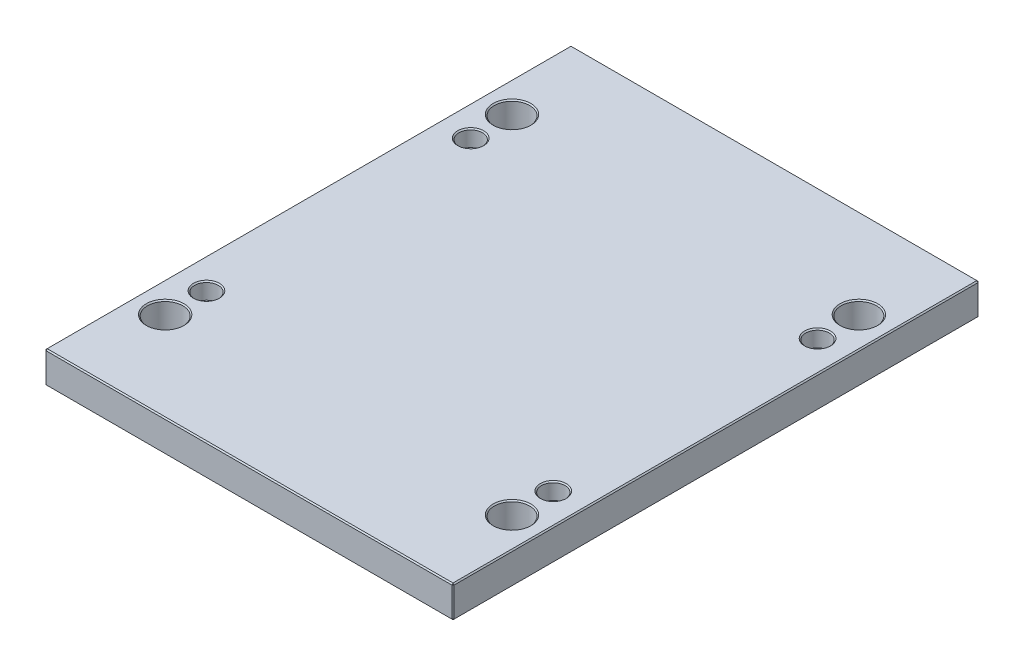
ISO-10303-21;
HEADER;
FILE_DESCRIPTION(('STEP AP214'),'2;1');
FILE_NAME('part.step','',(''),(''),'','','');
FILE_SCHEMA(('AUTOMOTIVE_DESIGN { 1 0 10303 214 1 1 1 1 }'));
ENDSEC;
DATA;
#1=APPLICATION_CONTEXT('core data for automotive mechanical design processes');
#2=APPLICATION_PROTOCOL_DEFINITION('international standard','automotive_design',2000,#1);
#3=PRODUCT_CONTEXT('',#1,'mechanical');
#4=PRODUCT('Part','Part','',(#3));
#5=PRODUCT_RELATED_PRODUCT_CATEGORY('part','',(#4));
#6=PRODUCT_DEFINITION_FORMATION('','',#4);
#7=PRODUCT_DEFINITION_CONTEXT('part definition',#1,'design');
#8=PRODUCT_DEFINITION('design','',#6,#7);
#9=PRODUCT_DEFINITION_SHAPE('','',#8);
#10=(LENGTH_UNIT() NAMED_UNIT(*) SI_UNIT(.MILLI.,.METRE.));
#11=(NAMED_UNIT(*) PLANE_ANGLE_UNIT() SI_UNIT($,.RADIAN.));
#12=(NAMED_UNIT(*) SI_UNIT($,.STERADIAN.) SOLID_ANGLE_UNIT());
#13=UNCERTAINTY_MEASURE_WITH_UNIT(LENGTH_MEASURE(1.E-05),#10,'distance_accuracy_value','');
#14=(GEOMETRIC_REPRESENTATION_CONTEXT(3) GLOBAL_UNCERTAINTY_ASSIGNED_CONTEXT((#13)) GLOBAL_UNIT_ASSIGNED_CONTEXT((#10,
#11,#12)) REPRESENTATION_CONTEXT('',''));
#15=CARTESIAN_POINT('',(0.,0.,0.));
#16=DIRECTION('',(0.,0.,1.));
#17=DIRECTION('',(1.,0.,0.));
#18=AXIS2_PLACEMENT_3D('',#15,#16,#17);
#19=CARTESIAN_POINT('',(-173.,27.,223.));
#20=DIRECTION('',(1.,0.,0.));
#21=DIRECTION('',(0.,0.,-1.));
#22=AXIS2_PLACEMENT_3D('',#19,#20,#21);
#23=PLANE('',#22);
#24=DIRECTION('',(0.,-1.,0.));
#25=VECTOR('',#24,1.);
#26=CARTESIAN_POINT('',(-173.,27.,-222.));
#27=LINE('',#26,#25);
#28=CARTESIAN_POINT('',(-173.,26.,-222.));
#29=VERTEX_POINT('',#28);
#30=CARTESIAN_POINT('',(-173.,0.999999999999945,-222.));
#31=VERTEX_POINT('',#30);
#32=EDGE_CURVE('E115',#29,#31,#27,.T.);
#33=ORIENTED_EDGE('',*,*,#32,.T.);
#34=DIRECTION('',(0.,0.,1.));
#35=VECTOR('',#34,1.);
#36=CARTESIAN_POINT('',(-173.,0.999999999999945,223.));
#37=LINE('',#36,#35);
#38=CARTESIAN_POINT('',(-173.,0.999999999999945,222.));
#39=VERTEX_POINT('',#38);
#40=EDGE_CURVE('E111',#31,#39,#37,.T.);
#41=ORIENTED_EDGE('',*,*,#40,.T.);
#42=DIRECTION('',(0.,1.,0.));
#43=VECTOR('',#42,1.);
#44=CARTESIAN_POINT('',(-173.,27.,222.));
#45=LINE('',#44,#43);
#46=CARTESIAN_POINT('',(-173.,26.,222.));
#47=VERTEX_POINT('',#46);
#48=EDGE_CURVE('E104',#39,#47,#45,.T.);
#49=ORIENTED_EDGE('',*,*,#48,.T.);
#50=DIRECTION('',(0.,0.,-1.));
#51=VECTOR('',#50,1.);
#52=CARTESIAN_POINT('',(-173.,26.,-223.));
#53=LINE('',#52,#51);
#54=EDGE_CURVE('E108',#47,#29,#53,.T.);
#55=ORIENTED_EDGE('',*,*,#54,.T.);
#56=EDGE_LOOP('',(#33,#41,#49,#55));
#57=FACE_BOUND('',#56,.T.);
#58=ADVANCED_FACE('F16',(#57),#23,.F.);
#59=CARTESIAN_POINT('',(173.,27.,223.));
#60=DIRECTION('',(0.,0.,-1.));
#61=DIRECTION('',(-1.,0.,0.));
#62=AXIS2_PLACEMENT_3D('',#59,#60,#61);
#63=PLANE('',#62);
#64=DIRECTION('',(-1.,0.,0.));
#65=VECTOR('',#64,1.);
#66=CARTESIAN_POINT('',(-173.,26.,223.));
#67=LINE('',#66,#65);
#68=CARTESIAN_POINT('',(172.,26.,223.));
#69=VERTEX_POINT('',#68);
#70=CARTESIAN_POINT('',(-172.,26.,223.));
#71=VERTEX_POINT('',#70);
#72=EDGE_CURVE('E170',#69,#71,#67,.T.);
#73=ORIENTED_EDGE('',*,*,#72,.T.);
#74=DIRECTION('',(0.,-1.,0.));
#75=VECTOR('',#74,1.);
#76=CARTESIAN_POINT('',(-172.,27.,223.));
#77=LINE('',#76,#75);
#78=CARTESIAN_POINT('',(-172.,0.999999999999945,223.));
#79=VERTEX_POINT('',#78);
#80=EDGE_CURVE('E123',#71,#79,#77,.T.);
#81=ORIENTED_EDGE('',*,*,#80,.T.);
#82=DIRECTION('',(1.,0.,0.));
#83=VECTOR('',#82,1.);
#84=CARTESIAN_POINT('',(173.,0.999999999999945,223.));
#85=LINE('',#84,#83);
#86=CARTESIAN_POINT('',(172.,0.999999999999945,223.));
#87=VERTEX_POINT('',#86);
#88=EDGE_CURVE('E174',#79,#87,#85,.T.);
#89=ORIENTED_EDGE('',*,*,#88,.T.);
#90=DIRECTION('',(0.,1.,0.));
#91=VECTOR('',#90,1.);
#92=CARTESIAN_POINT('',(172.,27.,223.));
#93=LINE('',#92,#91);
#94=EDGE_CURVE('E172',#87,#69,#93,.T.);
#95=ORIENTED_EDGE('',*,*,#94,.T.);
#96=EDGE_LOOP('',(#73,#81,#89,#95));
#97=FACE_BOUND('',#96,.T.);
#98=ADVANCED_FACE('F413',(#97),#63,.F.);
#99=CARTESIAN_POINT('',(173.,27.,223.));
#100=DIRECTION('',(-1.,0.,0.));
#101=DIRECTION('',(0.,0.,1.));
#102=AXIS2_PLACEMENT_3D('',#99,#100,#101);
#103=PLANE('',#102);
#104=DIRECTION('',(0.,0.,-1.));
#105=VECTOR('',#104,1.);
#106=CARTESIAN_POINT('',(173.,0.999999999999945,223.));
#107=LINE('',#106,#105);
#108=CARTESIAN_POINT('',(173.,0.999999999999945,222.));
#109=VERTEX_POINT('',#108);
#110=CARTESIAN_POINT('',(173.,0.999999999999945,-222.));
#111=VERTEX_POINT('',#110);
#112=EDGE_CURVE('E165',#109,#111,#107,.T.);
#113=ORIENTED_EDGE('',*,*,#112,.T.);
#114=DIRECTION('',(0.,1.,0.));
#115=VECTOR('',#114,1.);
#116=CARTESIAN_POINT('',(173.,27.,-222.));
#117=LINE('',#116,#115);
#118=CARTESIAN_POINT('',(173.,26.,-222.));
#119=VERTEX_POINT('',#118);
#120=EDGE_CURVE('E167',#111,#119,#117,.T.);
#121=ORIENTED_EDGE('',*,*,#120,.T.);
#122=DIRECTION('',(0.,0.,1.));
#123=VECTOR('',#122,1.);
#124=CARTESIAN_POINT('',(173.,26.,223.));
#125=LINE('',#124,#123);
#126=CARTESIAN_POINT('',(173.,26.,222.));
#127=VERTEX_POINT('',#126);
#128=EDGE_CURVE('E161',#119,#127,#125,.T.);
#129=ORIENTED_EDGE('',*,*,#128,.T.);
#130=DIRECTION('',(0.,-1.,0.));
#131=VECTOR('',#130,1.);
#132=CARTESIAN_POINT('',(173.,27.,222.));
#133=LINE('',#132,#131);
#134=EDGE_CURVE('E163',#127,#109,#133,.T.);
#135=ORIENTED_EDGE('',*,*,#134,.T.);
#136=EDGE_LOOP('',(#113,#121,#129,#135));
#137=FACE_BOUND('',#136,.T.);
#138=ADVANCED_FACE('F406',(#137),#103,.F.);
#139=CARTESIAN_POINT('',(173.,27.,-223.));
#140=DIRECTION('',(0.,0.,1.));
#141=DIRECTION('',(1.,0.,0.));
#142=AXIS2_PLACEMENT_3D('',#139,#140,#141);
#143=PLANE('',#142);
#144=DIRECTION('',(0.,-1.,0.));
#145=VECTOR('',#144,1.);
#146=CARTESIAN_POINT('',(172.,27.,-223.));
#147=LINE('',#146,#145);
#148=CARTESIAN_POINT('',(172.,26.,-223.));
#149=VERTEX_POINT('',#148);
#150=CARTESIAN_POINT('',(172.,0.999999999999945,-223.));
#151=VERTEX_POINT('',#150);
#152=EDGE_CURVE('E154',#149,#151,#147,.T.);
#153=ORIENTED_EDGE('',*,*,#152,.T.);
#154=DIRECTION('',(-1.,0.,0.));
#155=VECTOR('',#154,1.);
#156=CARTESIAN_POINT('',(173.,0.999999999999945,-223.));
#157=LINE('',#156,#155);
#158=CARTESIAN_POINT('',(-172.,0.999999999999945,-223.));
#159=VERTEX_POINT('',#158);
#160=EDGE_CURVE('E159',#151,#159,#157,.T.);
#161=ORIENTED_EDGE('',*,*,#160,.T.);
#162=DIRECTION('',(0.,1.,0.));
#163=VECTOR('',#162,1.);
#164=CARTESIAN_POINT('',(-172.,27.,-223.));
#165=LINE('',#164,#163);
#166=CARTESIAN_POINT('',(-172.,26.,-223.));
#167=VERTEX_POINT('',#166);
#168=EDGE_CURVE('E156',#159,#167,#165,.T.);
#169=ORIENTED_EDGE('',*,*,#168,.T.);
#170=DIRECTION('',(1.,0.,0.));
#171=VECTOR('',#170,1.);
#172=CARTESIAN_POINT('',(173.,26.,-223.));
#173=LINE('',#172,#171);
#174=EDGE_CURVE('E152',#167,#149,#173,.T.);
#175=ORIENTED_EDGE('',*,*,#174,.T.);
#176=EDGE_LOOP('',(#153,#161,#169,#175));
#177=FACE_BOUND('',#176,.T.);
#178=ADVANCED_FACE('F431',(#177),#143,.F.);
#179=CARTESIAN_POINT('',(0.,27.,0.));
#180=DIRECTION('',(0.,1.,0.));
#181=DIRECTION('',(0.,0.,1.));
#182=AXIS2_PLACEMENT_3D('',#179,#180,#181);
#183=PLANE('',#182);
#184=CARTESIAN_POINT('',(-147.,27.,147.));
#185=DIRECTION('',(0.,1.,0.));
#186=DIRECTION('',(0.,0.,1.));
#187=AXIS2_PLACEMENT_3D('',#184,#185,#186);
#188=CIRCLE('',#187,16.);
#189=CARTESIAN_POINT('',(-147.,27.,163.));
#190=VERTEX_POINT('',#189);
#191=EDGE_CURVE('E317',#190,#190,#188,.F.);
#192=ORIENTED_EDGE('',*,*,#191,.T.);
#193=EDGE_LOOP('',(#192));
#194=FACE_BOUND('',#193,.T.);
#195=CARTESIAN_POINT('',(147.,27.,147.));
#196=DIRECTION('',(0.,1.,0.));
#197=DIRECTION('',(0.,0.,1.));
#198=AXIS2_PLACEMENT_3D('',#195,#196,#197);
#199=CIRCLE('',#198,16.);
#200=CARTESIAN_POINT('',(147.,27.,163.));
#201=VERTEX_POINT('',#200);
#202=EDGE_CURVE('E314',#201,#201,#199,.F.);
#203=ORIENTED_EDGE('',*,*,#202,.T.);
#204=EDGE_LOOP('',(#203));
#205=FACE_BOUND('',#204,.T.);
#206=CARTESIAN_POINT('',(147.,27.,-147.));
#207=DIRECTION('',(0.,1.,0.));
#208=DIRECTION('',(0.,0.,1.));
#209=AXIS2_PLACEMENT_3D('',#206,#207,#208);
#210=CIRCLE('',#209,16.);
#211=CARTESIAN_POINT('',(147.,27.,-131.));
#212=VERTEX_POINT('',#211);
#213=EDGE_CURVE('E311',#212,#212,#210,.F.);
#214=ORIENTED_EDGE('',*,*,#213,.T.);
#215=EDGE_LOOP('',(#214));
#216=FACE_BOUND('',#215,.T.);
#217=CARTESIAN_POINT('',(-147.,27.,-147.));
#218=DIRECTION('',(0.,1.,0.));
#219=DIRECTION('',(0.,0.,1.));
#220=AXIS2_PLACEMENT_3D('',#217,#218,#219);
#221=CIRCLE('',#220,16.);
#222=CARTESIAN_POINT('',(-147.,27.,-131.));
#223=VERTEX_POINT('',#222);
#224=EDGE_CURVE('E308',#223,#223,#221,.F.);
#225=ORIENTED_EDGE('',*,*,#224,.T.);
#226=EDGE_LOOP('',(#225));
#227=FACE_BOUND('',#226,.T.);
#228=CARTESIAN_POINT('',(-147.,27.,112.));
#229=DIRECTION('',(0.,1.,0.));
#230=DIRECTION('',(0.,0.,1.));
#231=AXIS2_PLACEMENT_3D('',#228,#229,#230);
#232=CIRCLE('',#231,11.);
#233=CARTESIAN_POINT('',(-147.,27.,123.));
#234=VERTEX_POINT('',#233);
#235=EDGE_CURVE('E290',#234,#234,#232,.F.);
#236=ORIENTED_EDGE('',*,*,#235,.T.);
#237=EDGE_LOOP('',(#236));
#238=FACE_BOUND('',#237,.T.);
#239=CARTESIAN_POINT('',(147.,27.,112.));
#240=DIRECTION('',(0.,1.,0.));
#241=DIRECTION('',(0.,0.,1.));
#242=AXIS2_PLACEMENT_3D('',#239,#240,#241);
#243=CIRCLE('',#242,11.);
#244=CARTESIAN_POINT('',(147.,27.,123.));
#245=VERTEX_POINT('',#244);
#246=EDGE_CURVE('E287',#245,#245,#243,.F.);
#247=ORIENTED_EDGE('',*,*,#246,.T.);
#248=EDGE_LOOP('',(#247));
#249=FACE_BOUND('',#248,.T.);
#250=CARTESIAN_POINT('',(147.,27.,-112.));
#251=DIRECTION('',(0.,1.,0.));
#252=DIRECTION('',(0.,0.,1.));
#253=AXIS2_PLACEMENT_3D('',#250,#251,#252);
#254=CIRCLE('',#253,11.);
#255=CARTESIAN_POINT('',(147.,27.,-101.));
#256=VERTEX_POINT('',#255);
#257=EDGE_CURVE('E284',#256,#256,#254,.F.);
#258=ORIENTED_EDGE('',*,*,#257,.T.);
#259=EDGE_LOOP('',(#258));
#260=FACE_BOUND('',#259,.T.);
#261=CARTESIAN_POINT('',(-147.,27.,-112.));
#262=DIRECTION('',(0.,1.,0.));
#263=DIRECTION('',(0.,0.,1.));
#264=AXIS2_PLACEMENT_3D('',#261,#262,#263);
#265=CIRCLE('',#264,11.);
#266=CARTESIAN_POINT('',(-147.,27.,-101.));
#267=VERTEX_POINT('',#266);
#268=EDGE_CURVE('E281',#267,#267,#265,.F.);
#269=ORIENTED_EDGE('',*,*,#268,.T.);
#270=EDGE_LOOP('',(#269));
#271=FACE_BOUND('',#270,.T.);
#272=DIRECTION('',(0.,0.,-1.));
#273=VECTOR('',#272,1.);
#274=CARTESIAN_POINT('',(172.,27.,-223.));
#275=LINE('',#274,#273);
#276=CARTESIAN_POINT('',(172.,27.,222.));
#277=VERTEX_POINT('',#276);
#278=CARTESIAN_POINT('',(172.,27.,-222.));
#279=VERTEX_POINT('',#278);
#280=EDGE_CURVE('E31',#277,#279,#275,.T.);
#281=ORIENTED_EDGE('',*,*,#280,.T.);
#282=DIRECTION('',(-1.,0.,0.));
#283=VECTOR('',#282,1.);
#284=CARTESIAN_POINT('',(-173.,27.,-222.));
#285=LINE('',#284,#283);
#286=CARTESIAN_POINT('',(-172.,27.,-222.));
#287=VERTEX_POINT('',#286);
#288=EDGE_CURVE('E190',#279,#287,#285,.T.);
#289=ORIENTED_EDGE('',*,*,#288,.T.);
#290=DIRECTION('',(0.,0.,1.));
#291=VECTOR('',#290,1.);
#292=CARTESIAN_POINT('',(-172.,27.,223.));
#293=LINE('',#292,#291);
#294=CARTESIAN_POINT('',(-172.,27.,222.));
#295=VERTEX_POINT('',#294);
#296=EDGE_CURVE('E186',#287,#295,#293,.T.);
#297=ORIENTED_EDGE('',*,*,#296,.T.);
#298=DIRECTION('',(1.,0.,0.));
#299=VECTOR('',#298,1.);
#300=CARTESIAN_POINT('',(173.,27.,222.));
#301=LINE('',#300,#299);
#302=EDGE_CURVE('E36',#295,#277,#301,.T.);
#303=ORIENTED_EDGE('',*,*,#302,.T.);
#304=EDGE_LOOP('',(#281,#289,#297,#303));
#305=FACE_BOUND('',#304,.T.);
#306=ADVANCED_FACE('F357',(#194,#205,#216,#227,#238,#249,#260,#271,#305),#183,.T.);
#307=CARTESIAN_POINT('',(0.,0.,0.));
#308=DIRECTION('',(0.,1.,0.));
#309=DIRECTION('',(0.,0.,1.));
#310=AXIS2_PLACEMENT_3D('',#307,#308,#309);
#311=PLANE('',#310);
#312=CARTESIAN_POINT('',(-147.,0.,147.));
#313=DIRECTION('',(0.,1.,0.));
#314=DIRECTION('',(0.,0.,1.));
#315=AXIS2_PLACEMENT_3D('',#312,#313,#314);
#316=CIRCLE('',#315,16.);
#317=CARTESIAN_POINT('',(-147.,0.,163.));
#318=VERTEX_POINT('',#317);
#319=EDGE_CURVE('E329',#318,#318,#316,.T.);
#320=ORIENTED_EDGE('',*,*,#319,.T.);
#321=EDGE_LOOP('',(#320));
#322=FACE_BOUND('',#321,.T.);
#323=CARTESIAN_POINT('',(147.,0.,147.));
#324=DIRECTION('',(0.,1.,0.));
#325=DIRECTION('',(0.,0.,1.));
#326=AXIS2_PLACEMENT_3D('',#323,#324,#325);
#327=CIRCLE('',#326,16.);
#328=CARTESIAN_POINT('',(147.,0.,163.));
#329=VERTEX_POINT('',#328);
#330=EDGE_CURVE('E326',#329,#329,#327,.T.);
#331=ORIENTED_EDGE('',*,*,#330,.T.);
#332=EDGE_LOOP('',(#331));
#333=FACE_BOUND('',#332,.T.);
#334=CARTESIAN_POINT('',(147.,0.,-147.));
#335=DIRECTION('',(0.,1.,0.));
#336=DIRECTION('',(0.,0.,1.));
#337=AXIS2_PLACEMENT_3D('',#334,#335,#336);
#338=CIRCLE('',#337,16.);
#339=CARTESIAN_POINT('',(147.,0.,-131.));
#340=VERTEX_POINT('',#339);
#341=EDGE_CURVE('E323',#340,#340,#338,.T.);
#342=ORIENTED_EDGE('',*,*,#341,.T.);
#343=EDGE_LOOP('',(#342));
#344=FACE_BOUND('',#343,.T.);
#345=CARTESIAN_POINT('',(-147.,0.,-147.));
#346=DIRECTION('',(0.,1.,0.));
#347=DIRECTION('',(0.,0.,1.));
#348=AXIS2_PLACEMENT_3D('',#345,#346,#347);
#349=CIRCLE('',#348,16.);
#350=CARTESIAN_POINT('',(-147.,0.,-131.));
#351=VERTEX_POINT('',#350);
#352=EDGE_CURVE('E320',#351,#351,#349,.T.);
#353=ORIENTED_EDGE('',*,*,#352,.T.);
#354=EDGE_LOOP('',(#353));
#355=FACE_BOUND('',#354,.T.);
#356=CARTESIAN_POINT('',(147.,0.,-112.));
#357=DIRECTION('',(0.,1.,0.));
#358=DIRECTION('',(0.,0.,1.));
#359=AXIS2_PLACEMENT_3D('',#356,#357,#358);
#360=CIRCLE('',#359,8.);
#361=CARTESIAN_POINT('',(147.,0.,-104.));
#362=VERTEX_POINT('',#361);
#363=EDGE_CURVE('E263',#362,#362,#360,.T.);
#364=ORIENTED_EDGE('',*,*,#363,.T.);
#365=EDGE_LOOP('',(#364));
#366=FACE_BOUND('',#365,.T.);
#367=CARTESIAN_POINT('',(147.,0.,112.));
#368=DIRECTION('',(0.,1.,0.));
#369=DIRECTION('',(0.,0.,1.));
#370=AXIS2_PLACEMENT_3D('',#367,#368,#369);
#371=CIRCLE('',#370,8.);
#372=CARTESIAN_POINT('',(147.,0.,120.));
#373=VERTEX_POINT('',#372);
#374=EDGE_CURVE('E260',#373,#373,#371,.T.);
#375=ORIENTED_EDGE('',*,*,#374,.T.);
#376=EDGE_LOOP('',(#375));
#377=FACE_BOUND('',#376,.T.);
#378=CARTESIAN_POINT('',(-147.,0.,112.));
#379=DIRECTION('',(0.,1.,0.));
#380=DIRECTION('',(0.,0.,1.));
#381=AXIS2_PLACEMENT_3D('',#378,#379,#380);
#382=CIRCLE('',#381,8.);
#383=CARTESIAN_POINT('',(-147.,0.,120.));
#384=VERTEX_POINT('',#383);
#385=EDGE_CURVE('E257',#384,#384,#382,.T.);
#386=ORIENTED_EDGE('',*,*,#385,.T.);
#387=EDGE_LOOP('',(#386));
#388=FACE_BOUND('',#387,.T.);
#389=CARTESIAN_POINT('',(-147.,0.,-112.));
#390=DIRECTION('',(0.,1.,0.));
#391=DIRECTION('',(0.,0.,1.));
#392=AXIS2_PLACEMENT_3D('',#389,#390,#391);
#393=CIRCLE('',#392,8.);
#394=CARTESIAN_POINT('',(-147.,0.,-104.));
#395=VERTEX_POINT('',#394);
#396=EDGE_CURVE('E192',#395,#395,#393,.T.);
#397=ORIENTED_EDGE('',*,*,#396,.T.);
#398=EDGE_LOOP('',(#397));
#399=FACE_BOUND('',#398,.T.);
#400=DIRECTION('',(0.,0.,1.));
#401=VECTOR('',#400,1.);
#402=CARTESIAN_POINT('',(172.,0.,0.));
#403=LINE('',#402,#401);
#404=CARTESIAN_POINT('',(172.,0.,-222.));
#405=VERTEX_POINT('',#404);
#406=CARTESIAN_POINT('',(172.,0.,222.));
#407=VERTEX_POINT('',#406);
#408=EDGE_CURVE('E177',#405,#407,#403,.T.);
#409=ORIENTED_EDGE('',*,*,#408,.T.);
#410=DIRECTION('',(-1.,0.,0.));
#411=VECTOR('',#410,1.);
#412=CARTESIAN_POINT('',(0.,0.,222.));
#413=LINE('',#412,#411);
#414=CARTESIAN_POINT('',(-172.,0.,222.));
#415=VERTEX_POINT('',#414);
#416=EDGE_CURVE('E183',#407,#415,#413,.T.);
#417=ORIENTED_EDGE('',*,*,#416,.T.);
#418=DIRECTION('',(0.,0.,-1.));
#419=VECTOR('',#418,1.);
#420=CARTESIAN_POINT('',(-172.,0.,0.));
#421=LINE('',#420,#419);
#422=CARTESIAN_POINT('',(-172.,0.,-222.));
#423=VERTEX_POINT('',#422);
#424=EDGE_CURVE('E181',#415,#423,#421,.T.);
#425=ORIENTED_EDGE('',*,*,#424,.T.);
#426=DIRECTION('',(1.,0.,0.));
#427=VECTOR('',#426,1.);
#428=CARTESIAN_POINT('',(0.,0.,-222.));
#429=LINE('',#428,#427);
#430=EDGE_CURVE('E179',#423,#405,#429,.T.);
#431=ORIENTED_EDGE('',*,*,#430,.T.);
#432=EDGE_LOOP('',(#409,#417,#425,#431));
#433=FACE_BOUND('',#432,.T.);
#434=ADVANCED_FACE('F353',(#322,#333,#344,#355,#366,#377,#388,#399,#433),#311,.F.);
#435=CARTESIAN_POINT('',(173.,27.,222.));
#436=DIRECTION('',(-0.707106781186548,0.,-0.707106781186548));
#437=DIRECTION('',(0.,-1.,0.));
#438=AXIS2_PLACEMENT_3D('',#435,#436,#437);
#439=PLANE('',#438);
#440=DIRECTION('',(-0.707106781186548,0.,0.707106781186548));
#441=VECTOR('',#440,1.);
#442=CARTESIAN_POINT('',(172.,26.,223.));
#443=LINE('',#442,#441);
#444=EDGE_CURVE('E141',#69,#127,#443,.F.);
#445=ORIENTED_EDGE('',*,*,#444,.F.);
#446=ORIENTED_EDGE('',*,*,#94,.F.);
#447=DIRECTION('',(0.707106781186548,0.,-0.707106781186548));
#448=VECTOR('',#447,1.);
#449=CARTESIAN_POINT('',(172.,0.999999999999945,223.));
#450=LINE('',#449,#448);
#451=EDGE_CURVE('E144',#109,#87,#450,.F.);
#452=ORIENTED_EDGE('',*,*,#451,.F.);
#453=ORIENTED_EDGE('',*,*,#134,.F.);
#454=EDGE_LOOP('',(#445,#446,#452,#453));
#455=FACE_BOUND('',#454,.T.);
#456=ADVANCED_FACE('F356',(#455),#439,.F.);
#457=CARTESIAN_POINT('',(172.,26.,223.));
#458=DIRECTION('',(0.577350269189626,0.577350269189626,0.577350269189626));
#459=DIRECTION('',(0.707106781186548,0.,-0.707106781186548));
#460=AXIS2_PLACEMENT_3D('',#457,#458,#459);
#461=PLANE('',#460);
#462=DIRECTION('',(0.,-0.707106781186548,0.707106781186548));
#463=VECTOR('',#462,1.);
#464=CARTESIAN_POINT('',(172.,26.,223.));
#465=LINE('',#464,#463);
#466=EDGE_CURVE('E235',#69,#277,#465,.F.);
#467=ORIENTED_EDGE('',*,*,#466,.F.);
#468=ORIENTED_EDGE('',*,*,#444,.T.);
#469=DIRECTION('',(-0.707106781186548,0.707106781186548,0.));
#470=VECTOR('',#469,1.);
#471=CARTESIAN_POINT('',(172.5,26.5,222.));
#472=LINE('',#471,#470);
#473=EDGE_CURVE('E237',#277,#127,#472,.F.);
#474=ORIENTED_EDGE('',*,*,#473,.F.);
#475=EDGE_LOOP('',(#467,#468,#474));
#476=FACE_BOUND('',#475,.T.);
#477=ADVANCED_FACE('F419',(#476),#461,.T.);
#478=CARTESIAN_POINT('',(172.,0.999999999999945,223.));
#479=DIRECTION('',(0.577350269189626,-0.577350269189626,0.577350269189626));
#480=DIRECTION('',(0.707106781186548,0.,-0.707106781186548));
#481=AXIS2_PLACEMENT_3D('',#478,#479,#480);
#482=PLANE('',#481);
#483=DIRECTION('',(-0.707106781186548,-0.707106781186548,0.));
#484=VECTOR('',#483,1.);
#485=CARTESIAN_POINT('',(172.5,0.499999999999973,222.));
#486=LINE('',#485,#484);
#487=EDGE_CURVE('E229',#109,#407,#486,.T.);
#488=ORIENTED_EDGE('',*,*,#487,.F.);
#489=ORIENTED_EDGE('',*,*,#451,.T.);
#490=DIRECTION('',(0.,0.707106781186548,0.707106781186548));
#491=VECTOR('',#490,1.);
#492=CARTESIAN_POINT('',(172.,0.999999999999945,223.));
#493=LINE('',#492,#491);
#494=EDGE_CURVE('E232',#407,#87,#493,.T.);
#495=ORIENTED_EDGE('',*,*,#494,.F.);
#496=EDGE_LOOP('',(#488,#489,#495));
#497=FACE_BOUND('',#496,.T.);
#498=ADVANCED_FACE('F378',(#497),#482,.T.);
#499=CARTESIAN_POINT('',(172.,27.,0.));
#500=DIRECTION('',(0.707106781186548,0.707106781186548,0.));
#501=DIRECTION('',(0.,0.,1.));
#502=AXIS2_PLACEMENT_3D('',#499,#500,#501);
#503=PLANE('',#502);
#504=ORIENTED_EDGE('',*,*,#473,.T.);
#505=ORIENTED_EDGE('',*,*,#128,.F.);
#506=DIRECTION('',(0.707106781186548,-0.707106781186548,0.));
#507=VECTOR('',#506,1.);
#508=CARTESIAN_POINT('',(173.,26.,-222.));
#509=LINE('',#508,#507);
#510=EDGE_CURVE('E224',#279,#119,#509,.T.);
#511=ORIENTED_EDGE('',*,*,#510,.F.);
#512=ORIENTED_EDGE('',*,*,#280,.F.);
#513=EDGE_LOOP('',(#504,#505,#511,#512));
#514=FACE_BOUND('',#513,.T.);
#515=ADVANCED_FACE('F421',(#514),#503,.T.);
#516=CARTESIAN_POINT('',(0.,27.,222.));
#517=DIRECTION('',(0.,0.707106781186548,0.707106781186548));
#518=DIRECTION('',(-1.,0.,0.));
#519=AXIS2_PLACEMENT_3D('',#516,#517,#518);
#520=PLANE('',#519);
#521=ORIENTED_EDGE('',*,*,#466,.T.);
#522=ORIENTED_EDGE('',*,*,#302,.F.);
#523=DIRECTION('',(0.,0.707106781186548,-0.707106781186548));
#524=VECTOR('',#523,1.);
#525=CARTESIAN_POINT('',(-172.,26.5,222.5));
#526=LINE('',#525,#524);
#527=EDGE_CURVE('E127',#71,#295,#526,.T.);
#528=ORIENTED_EDGE('',*,*,#527,.F.);
#529=ORIENTED_EDGE('',*,*,#72,.F.);
#530=EDGE_LOOP('',(#521,#522,#528,#529));
#531=FACE_BOUND('',#530,.T.);
#532=ADVANCED_FACE('F416',(#531),#520,.T.);
#533=CARTESIAN_POINT('',(-172.,27.,223.));
#534=DIRECTION('',(0.707106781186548,0.,-0.707106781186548));
#535=DIRECTION('',(0.,-1.,0.));
#536=AXIS2_PLACEMENT_3D('',#533,#534,#535);
#537=PLANE('',#536);
#538=DIRECTION('',(0.707106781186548,0.,0.707106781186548));
#539=VECTOR('',#538,1.);
#540=CARTESIAN_POINT('',(-172.,0.999999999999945,223.));
#541=LINE('',#540,#539);
#542=EDGE_CURVE('E128',#79,#39,#541,.F.);
#543=ORIENTED_EDGE('',*,*,#542,.F.);
#544=ORIENTED_EDGE('',*,*,#80,.F.);
#545=DIRECTION('',(-0.707106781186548,0.,-0.707106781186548));
#546=VECTOR('',#545,1.);
#547=CARTESIAN_POINT('',(-173.,26.,222.));
#548=LINE('',#547,#546);
#549=EDGE_CURVE('E119',#47,#71,#548,.F.);
#550=ORIENTED_EDGE('',*,*,#549,.F.);
#551=ORIENTED_EDGE('',*,*,#48,.F.);
#552=EDGE_LOOP('',(#543,#544,#550,#551));
#553=FACE_BOUND('',#552,.T.);
#554=ADVANCED_FACE('F121',(#553),#537,.F.);
#555=CARTESIAN_POINT('',(173.,0.999999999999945,223.));
#556=DIRECTION('',(0.,0.707106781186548,-0.707106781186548));
#557=DIRECTION('',(1.,0.,0.));
#558=AXIS2_PLACEMENT_3D('',#555,#556,#557);
#559=PLANE('',#558);
#560=ORIENTED_EDGE('',*,*,#494,.T.);
#561=ORIENTED_EDGE('',*,*,#88,.F.);
#562=DIRECTION('',(0.,-0.707106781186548,-0.707106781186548));
#563=VECTOR('',#562,1.);
#564=CARTESIAN_POINT('',(-172.,0.999999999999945,223.));
#565=LINE('',#564,#563);
#566=EDGE_CURVE('E220',#415,#79,#565,.F.);
#567=ORIENTED_EDGE('',*,*,#566,.F.);
#568=ORIENTED_EDGE('',*,*,#416,.F.);
#569=EDGE_LOOP('',(#560,#561,#567,#568));
#570=FACE_BOUND('',#569,.T.);
#571=ADVANCED_FACE('F383',(#570),#559,.F.);
#572=CARTESIAN_POINT('',(173.,0.999999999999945,223.));
#573=DIRECTION('',(-0.707106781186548,0.707106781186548,0.));
#574=DIRECTION('',(0.,0.,-1.));
#575=AXIS2_PLACEMENT_3D('',#572,#573,#574);
#576=PLANE('',#575);
#577=ORIENTED_EDGE('',*,*,#487,.T.);
#578=ORIENTED_EDGE('',*,*,#408,.F.);
#579=DIRECTION('',(0.707106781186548,0.707106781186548,0.));
#580=VECTOR('',#579,1.);
#581=CARTESIAN_POINT('',(172.5,0.499999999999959,-222.));
#582=LINE('',#581,#580);
#583=EDGE_CURVE('E217',#111,#405,#582,.F.);
#584=ORIENTED_EDGE('',*,*,#583,.F.);
#585=ORIENTED_EDGE('',*,*,#112,.F.);
#586=EDGE_LOOP('',(#577,#578,#584,#585));
#587=FACE_BOUND('',#586,.T.);
#588=ADVANCED_FACE('F376',(#587),#576,.F.);
#589=CARTESIAN_POINT('',(172.,27.,-223.));
#590=DIRECTION('',(-0.707106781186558,0.,0.707106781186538));
#591=DIRECTION('',(0.,-1.,0.));
#592=AXIS2_PLACEMENT_3D('',#589,#590,#591);
#593=PLANE('',#592);
#594=DIRECTION('',(0.707106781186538,0.,0.707106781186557));
#595=VECTOR('',#594,1.);
#596=CARTESIAN_POINT('',(173.,26.,-222.));
#597=LINE('',#596,#595);
#598=EDGE_CURVE('E226',#119,#149,#597,.F.);
#599=ORIENTED_EDGE('',*,*,#598,.F.);
#600=ORIENTED_EDGE('',*,*,#120,.F.);
#601=DIRECTION('',(-0.707106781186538,0.,-0.707106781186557));
#602=VECTOR('',#601,1.);
#603=CARTESIAN_POINT('',(172.,0.999999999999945,-223.));
#604=LINE('',#603,#602);
#605=EDGE_CURVE('E214',#151,#111,#604,.F.);
#606=ORIENTED_EDGE('',*,*,#605,.F.);
#607=ORIENTED_EDGE('',*,*,#152,.F.);
#608=EDGE_LOOP('',(#599,#600,#606,#607));
#609=FACE_BOUND('',#608,.T.);
#610=ADVANCED_FACE('F403',(#609),#593,.F.);
#611=CARTESIAN_POINT('',(173.,26.,-222.));
#612=DIRECTION('',(0.577350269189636,0.57735026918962,-0.57735026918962));
#613=DIRECTION('',(-0.707106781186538,0.,-0.707106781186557));
#614=AXIS2_PLACEMENT_3D('',#611,#612,#613);
#615=PLANE('',#614);
#616=ORIENTED_EDGE('',*,*,#510,.T.);
#617=ORIENTED_EDGE('',*,*,#598,.T.);
#618=DIRECTION('',(0.,0.707106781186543,0.707106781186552));
#619=VECTOR('',#618,1.);
#620=CARTESIAN_POINT('',(172.,26.5,-222.5));
#621=LINE('',#620,#619);
#622=EDGE_CURVE('E135',#279,#149,#621,.F.);
#623=ORIENTED_EDGE('',*,*,#622,.F.);
#624=EDGE_LOOP('',(#616,#617,#623));
#625=FACE_BOUND('',#624,.T.);
#626=ADVANCED_FACE('F425',(#625),#615,.T.);
#627=CARTESIAN_POINT('',(-173.,26.,222.));
#628=DIRECTION('',(-0.577350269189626,0.577350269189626,0.577350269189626));
#629=DIRECTION('',(0.707106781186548,0.,0.707106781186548));
#630=AXIS2_PLACEMENT_3D('',#627,#628,#629);
#631=PLANE('',#630);
#632=ORIENTED_EDGE('',*,*,#549,.T.);
#633=ORIENTED_EDGE('',*,*,#527,.T.);
#634=DIRECTION('',(-0.707106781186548,-0.707106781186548,0.));
#635=VECTOR('',#634,1.);
#636=CARTESIAN_POINT('',(-173.,26.,222.));
#637=LINE('',#636,#635);
#638=EDGE_CURVE('E131',#47,#295,#637,.F.);
#639=ORIENTED_EDGE('',*,*,#638,.F.);
#640=EDGE_LOOP('',(#632,#633,#639));
#641=FACE_BOUND('',#640,.T.);
#642=ADVANCED_FACE('F132',(#641),#631,.T.);
#643=CARTESIAN_POINT('',(-172.,0.999999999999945,223.));
#644=DIRECTION('',(-0.577350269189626,-0.577350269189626,0.577350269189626));
#645=DIRECTION('',(0.707106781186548,0.,0.707106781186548));
#646=AXIS2_PLACEMENT_3D('',#643,#644,#645);
#647=PLANE('',#646);
#648=ORIENTED_EDGE('',*,*,#566,.T.);
#649=ORIENTED_EDGE('',*,*,#542,.T.);
#650=DIRECTION('',(-0.707106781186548,0.707106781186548,0.));
#651=VECTOR('',#650,1.);
#652=CARTESIAN_POINT('',(-172.5,0.499999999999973,222.));
#653=LINE('',#652,#651);
#654=EDGE_CURVE('E136',#415,#39,#653,.T.);
#655=ORIENTED_EDGE('',*,*,#654,.F.);
#656=EDGE_LOOP('',(#648,#649,#655));
#657=FACE_BOUND('',#656,.T.);
#658=ADVANCED_FACE('F386',(#657),#647,.T.);
#659=CARTESIAN_POINT('',(172.,0.999999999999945,-223.));
#660=DIRECTION('',(0.577350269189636,-0.57735026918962,-0.57735026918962));
#661=DIRECTION('',(-0.707106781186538,0.,-0.707106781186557));
#662=AXIS2_PLACEMENT_3D('',#659,#660,#661);
#663=PLANE('',#662);
#664=ORIENTED_EDGE('',*,*,#605,.T.);
#665=ORIENTED_EDGE('',*,*,#583,.T.);
#666=DIRECTION('',(0.,-0.707106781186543,0.707106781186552));
#667=VECTOR('',#666,1.);
#668=CARTESIAN_POINT('',(172.,0.999999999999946,-223.));
#669=LINE('',#668,#667);
#670=EDGE_CURVE('E207',#151,#405,#669,.T.);
#671=ORIENTED_EDGE('',*,*,#670,.F.);
#672=EDGE_LOOP('',(#664,#665,#671));
#673=FACE_BOUND('',#672,.T.);
#674=ADVANCED_FACE('F397',(#673),#663,.T.);
#675=CARTESIAN_POINT('',(0.,27.,-222.));
#676=DIRECTION('',(0.,0.707106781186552,-0.707106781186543));
#677=DIRECTION('',(1.,0.,0.));
#678=AXIS2_PLACEMENT_3D('',#675,#676,#677);
#679=PLANE('',#678);
#680=ORIENTED_EDGE('',*,*,#622,.T.);
#681=ORIENTED_EDGE('',*,*,#174,.F.);
#682=DIRECTION('',(0.,-0.707106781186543,-0.707106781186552));
#683=VECTOR('',#682,1.);
#684=CARTESIAN_POINT('',(-172.,26.,-223.));
#685=LINE('',#684,#683);
#686=EDGE_CURVE('E204',#287,#167,#685,.T.);
#687=ORIENTED_EDGE('',*,*,#686,.F.);
#688=ORIENTED_EDGE('',*,*,#288,.F.);
#689=EDGE_LOOP('',(#680,#681,#687,#688));
#690=FACE_BOUND('',#689,.T.);
#691=ADVANCED_FACE('F429',(#690),#679,.T.);
#692=CARTESIAN_POINT('',(-172.,27.,0.));
#693=DIRECTION('',(-0.707106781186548,0.707106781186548,0.));
#694=DIRECTION('',(0.,0.,-1.));
#695=AXIS2_PLACEMENT_3D('',#692,#693,#694);
#696=PLANE('',#695);
#697=ORIENTED_EDGE('',*,*,#638,.T.);
#698=ORIENTED_EDGE('',*,*,#296,.F.);
#699=DIRECTION('',(0.707106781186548,0.707106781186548,0.));
#700=VECTOR('',#699,1.);
#701=CARTESIAN_POINT('',(-172.5,26.5,-222.));
#702=LINE('',#701,#700);
#703=EDGE_CURVE('E139',#29,#287,#702,.T.);
#704=ORIENTED_EDGE('',*,*,#703,.F.);
#705=ORIENTED_EDGE('',*,*,#54,.F.);
#706=EDGE_LOOP('',(#697,#698,#704,#705));
#707=FACE_BOUND('',#706,.T.);
#708=ADVANCED_FACE('F138',(#707),#696,.T.);
#709=CARTESIAN_POINT('',(-173.,0.999999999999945,223.));
#710=DIRECTION('',(0.707106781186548,0.707106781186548,0.));
#711=DIRECTION('',(0.,0.,1.));
#712=AXIS2_PLACEMENT_3D('',#709,#710,#711);
#713=PLANE('',#712);
#714=ORIENTED_EDGE('',*,*,#654,.T.);
#715=ORIENTED_EDGE('',*,*,#40,.F.);
#716=DIRECTION('',(0.707106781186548,-0.707106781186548,0.));
#717=VECTOR('',#716,1.);
#718=CARTESIAN_POINT('',(-173.,0.999999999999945,-222.));
#719=LINE('',#718,#717);
#720=EDGE_CURVE('E200',#423,#31,#719,.F.);
#721=ORIENTED_EDGE('',*,*,#720,.F.);
#722=ORIENTED_EDGE('',*,*,#424,.F.);
#723=EDGE_LOOP('',(#714,#715,#721,#722));
#724=FACE_BOUND('',#723,.T.);
#725=ADVANCED_FACE('F388',(#724),#713,.F.);
#726=CARTESIAN_POINT('',(173.,0.999999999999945,-223.));
#727=DIRECTION('',(0.,0.707106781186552,0.707106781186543));
#728=DIRECTION('',(-1.,0.,0.));
#729=AXIS2_PLACEMENT_3D('',#726,#727,#728);
#730=PLANE('',#729);
#731=ORIENTED_EDGE('',*,*,#670,.T.);
#732=ORIENTED_EDGE('',*,*,#430,.F.);
#733=DIRECTION('',(0.,0.707106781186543,-0.707106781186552));
#734=VECTOR('',#733,1.);
#735=CARTESIAN_POINT('',(-172.,0.499999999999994,-222.5));
#736=LINE('',#735,#734);
#737=EDGE_CURVE('E197',#159,#423,#736,.F.);
#738=ORIENTED_EDGE('',*,*,#737,.F.);
#739=ORIENTED_EDGE('',*,*,#160,.F.);
#740=EDGE_LOOP('',(#731,#732,#738,#739));
#741=FACE_BOUND('',#740,.T.);
#742=ADVANCED_FACE('F392',(#741),#730,.F.);
#743=CARTESIAN_POINT('',(-172.,26.,-223.));
#744=DIRECTION('',(-0.577350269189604,0.577350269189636,-0.577350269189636));
#745=DIRECTION('',(0.,0.707106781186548,0.707106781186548));
#746=AXIS2_PLACEMENT_3D('',#743,#744,#745);
#747=PLANE('',#746);
#748=ORIENTED_EDGE('',*,*,#703,.T.);
#749=ORIENTED_EDGE('',*,*,#686,.T.);
#750=DIRECTION('',(0.707106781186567,0.,-0.707106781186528));
#751=VECTOR('',#750,1.);
#752=CARTESIAN_POINT('',(-172.,26.,-223.));
#753=LINE('',#752,#751);
#754=EDGE_CURVE('E195',#29,#167,#753,.T.);
#755=ORIENTED_EDGE('',*,*,#754,.F.);
#756=EDGE_LOOP('',(#748,#749,#755));
#757=FACE_BOUND('',#756,.T.);
#758=ADVANCED_FACE('F460',(#757),#747,.T.);
#759=CARTESIAN_POINT('',(-173.,0.999999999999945,-222.));
#760=DIRECTION('',(-0.577350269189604,-0.577350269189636,-0.577350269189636));
#761=DIRECTION('',(0.,0.707106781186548,-0.707106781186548));
#762=AXIS2_PLACEMENT_3D('',#759,#760,#761);
#763=PLANE('',#762);
#764=ORIENTED_EDGE('',*,*,#737,.T.);
#765=ORIENTED_EDGE('',*,*,#720,.T.);
#766=DIRECTION('',(-0.707106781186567,0.,0.707106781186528));
#767=VECTOR('',#766,1.);
#768=CARTESIAN_POINT('',(-173.,0.999999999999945,-222.));
#769=LINE('',#768,#767);
#770=EDGE_CURVE('E193',#159,#31,#769,.T.);
#771=ORIENTED_EDGE('',*,*,#770,.F.);
#772=EDGE_LOOP('',(#764,#765,#771));
#773=FACE_BOUND('',#772,.T.);
#774=ADVANCED_FACE('F456',(#773),#763,.T.);
#775=CARTESIAN_POINT('',(-173.,27.,-222.));
#776=DIRECTION('',(0.707106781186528,0.,0.707106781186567));
#777=DIRECTION('',(0.,-1.,0.));
#778=AXIS2_PLACEMENT_3D('',#775,#776,#777);
#779=PLANE('',#778);
#780=ORIENTED_EDGE('',*,*,#754,.T.);
#781=ORIENTED_EDGE('',*,*,#168,.F.);
#782=ORIENTED_EDGE('',*,*,#770,.T.);
#783=ORIENTED_EDGE('',*,*,#32,.F.);
#784=EDGE_LOOP('',(#780,#781,#782,#783));
#785=FACE_BOUND('',#784,.T.);
#786=ADVANCED_FACE('F452',(#785),#779,.F.);
#787=CARTESIAN_POINT('',(-147.,13.,-112.));
#788=DIRECTION('',(0.,1.,0.));
#789=DIRECTION('',(0.,0.,1.));
#790=AXIS2_PLACEMENT_3D('',#787,#788,#789);
#791=CYLINDRICAL_SURFACE('',#790,10.);
#792=CARTESIAN_POINT('',(-147.,26.,-112.));
#793=DIRECTION('',(0.,1.,0.));
#794=DIRECTION('',(0.,0.,1.));
#795=AXIS2_PLACEMENT_3D('',#792,#793,#794);
#796=CIRCLE('',#795,10.);
#797=CARTESIAN_POINT('',(-147.,26.,-102.));
#798=VERTEX_POINT('',#797);
#799=EDGE_CURVE('E299',#798,#798,#796,.T.);
#800=ORIENTED_EDGE('',*,*,#799,.T.);
#801=EDGE_LOOP('',(#800));
#802=FACE_BOUND('',#801,.T.);
#803=CARTESIAN_POINT('',(-147.,13.,-112.));
#804=DIRECTION('',(0.,1.,0.));
#805=DIRECTION('',(0.,0.,1.));
#806=AXIS2_PLACEMENT_3D('',#803,#804,#805);
#807=CIRCLE('',#806,10.);
#808=CARTESIAN_POINT('',(-147.,13.,-102.));
#809=VERTEX_POINT('',#808);
#810=EDGE_CURVE('E147',#809,#809,#807,.T.);
#811=ORIENTED_EDGE('',*,*,#810,.F.);
#812=EDGE_LOOP('',(#811));
#813=FACE_BOUND('',#812,.T.);
#814=ADVANCED_FACE('F455',(#802,#813),#791,.F.);
#815=CARTESIAN_POINT('',(-147.,13.,-112.));
#816=DIRECTION('',(0.,1.,0.));
#817=DIRECTION('',(0.,0.,1.));
#818=AXIS2_PLACEMENT_3D('',#815,#816,#817);
#819=PLANE('',#818);
#820=CARTESIAN_POINT('',(-147.,13.,-112.));
#821=DIRECTION('',(0.,1.,0.));
#822=DIRECTION('',(0.,0.,1.));
#823=AXIS2_PLACEMENT_3D('',#820,#821,#822);
#824=CIRCLE('',#823,7.);
#825=CARTESIAN_POINT('',(-147.,13.,-105.));
#826=VERTEX_POINT('',#825);
#827=EDGE_CURVE('E251',#826,#826,#824,.T.);
#828=ORIENTED_EDGE('',*,*,#827,.F.);
#829=EDGE_LOOP('',(#828));
#830=FACE_BOUND('',#829,.T.);
#831=ORIENTED_EDGE('',*,*,#810,.T.);
#832=EDGE_LOOP('',(#831));
#833=FACE_BOUND('',#832,.T.);
#834=ADVANCED_FACE('F602',(#830,#833),#819,.T.);
#835=CARTESIAN_POINT('',(147.,13.,-112.));
#836=DIRECTION('',(0.,1.,0.));
#837=DIRECTION('',(0.,0.,1.));
#838=AXIS2_PLACEMENT_3D('',#835,#836,#837);
#839=CYLINDRICAL_SURFACE('',#838,10.);
#840=CARTESIAN_POINT('',(147.,26.,-112.));
#841=DIRECTION('',(0.,1.,0.));
#842=DIRECTION('',(0.,0.,1.));
#843=AXIS2_PLACEMENT_3D('',#840,#841,#842);
#844=CIRCLE('',#843,10.);
#845=CARTESIAN_POINT('',(147.,26.,-102.));
#846=VERTEX_POINT('',#845);
#847=EDGE_CURVE('E296',#846,#846,#844,.T.);
#848=ORIENTED_EDGE('',*,*,#847,.T.);
#849=EDGE_LOOP('',(#848));
#850=FACE_BOUND('',#849,.T.);
#851=CARTESIAN_POINT('',(147.,13.,-112.));
#852=DIRECTION('',(0.,1.,0.));
#853=DIRECTION('',(0.,0.,1.));
#854=AXIS2_PLACEMENT_3D('',#851,#852,#853);
#855=CIRCLE('',#854,10.);
#856=CARTESIAN_POINT('',(147.,13.,-102.));
#857=VERTEX_POINT('',#856);
#858=EDGE_CURVE('E630',#857,#857,#855,.T.);
#859=ORIENTED_EDGE('',*,*,#858,.F.);
#860=EDGE_LOOP('',(#859));
#861=FACE_BOUND('',#860,.T.);
#862=ADVANCED_FACE('F598',(#850,#861),#839,.F.);
#863=CARTESIAN_POINT('',(147.,13.,-112.));
#864=DIRECTION('',(0.,1.,0.));
#865=DIRECTION('',(0.,0.,1.));
#866=AXIS2_PLACEMENT_3D('',#863,#864,#865);
#867=PLANE('',#866);
#868=CARTESIAN_POINT('',(147.,13.,-112.));
#869=DIRECTION('',(0.,1.,0.));
#870=DIRECTION('',(0.,0.,1.));
#871=AXIS2_PLACEMENT_3D('',#868,#869,#870);
#872=CIRCLE('',#871,7.);
#873=CARTESIAN_POINT('',(147.,13.,-105.));
#874=VERTEX_POINT('',#873);
#875=EDGE_CURVE('E248',#874,#874,#872,.T.);
#876=ORIENTED_EDGE('',*,*,#875,.F.);
#877=EDGE_LOOP('',(#876));
#878=FACE_BOUND('',#877,.T.);
#879=ORIENTED_EDGE('',*,*,#858,.T.);
#880=EDGE_LOOP('',(#879));
#881=FACE_BOUND('',#880,.T.);
#882=ADVANCED_FACE('F594',(#878,#881),#867,.T.);
#883=CARTESIAN_POINT('',(147.,13.,112.));
#884=DIRECTION('',(0.,1.,0.));
#885=DIRECTION('',(0.,0.,1.));
#886=AXIS2_PLACEMENT_3D('',#883,#884,#885);
#887=CYLINDRICAL_SURFACE('',#886,10.);
#888=CARTESIAN_POINT('',(147.,26.,112.));
#889=DIRECTION('',(0.,1.,0.));
#890=DIRECTION('',(0.,0.,1.));
#891=AXIS2_PLACEMENT_3D('',#888,#889,#890);
#892=CIRCLE('',#891,10.);
#893=CARTESIAN_POINT('',(147.,26.,122.));
#894=VERTEX_POINT('',#893);
#895=EDGE_CURVE('E293',#894,#894,#892,.T.);
#896=ORIENTED_EDGE('',*,*,#895,.T.);
#897=EDGE_LOOP('',(#896));
#898=FACE_BOUND('',#897,.T.);
#899=CARTESIAN_POINT('',(147.,13.,112.));
#900=DIRECTION('',(0.,1.,0.));
#901=DIRECTION('',(0.,0.,1.));
#902=AXIS2_PLACEMENT_3D('',#899,#900,#901);
#903=CIRCLE('',#902,10.);
#904=CARTESIAN_POINT('',(147.,13.,122.));
#905=VERTEX_POINT('',#904);
#906=EDGE_CURVE('E632',#905,#905,#903,.T.);
#907=ORIENTED_EDGE('',*,*,#906,.F.);
#908=EDGE_LOOP('',(#907));
#909=FACE_BOUND('',#908,.T.);
#910=ADVANCED_FACE('F597',(#898,#909),#887,.F.);
#911=CARTESIAN_POINT('',(147.,13.,112.));
#912=DIRECTION('',(0.,1.,0.));
#913=DIRECTION('',(0.,0.,1.));
#914=AXIS2_PLACEMENT_3D('',#911,#912,#913);
#915=PLANE('',#914);
#916=CARTESIAN_POINT('',(147.,13.,112.));
#917=DIRECTION('',(0.,1.,0.));
#918=DIRECTION('',(0.,0.,1.));
#919=AXIS2_PLACEMENT_3D('',#916,#917,#918);
#920=CIRCLE('',#919,7.);
#921=CARTESIAN_POINT('',(147.,13.,119.));
#922=VERTEX_POINT('',#921);
#923=EDGE_CURVE('E245',#922,#922,#920,.T.);
#924=ORIENTED_EDGE('',*,*,#923,.F.);
#925=EDGE_LOOP('',(#924));
#926=FACE_BOUND('',#925,.T.);
#927=ORIENTED_EDGE('',*,*,#906,.T.);
#928=EDGE_LOOP('',(#927));
#929=FACE_BOUND('',#928,.T.);
#930=ADVANCED_FACE('F604',(#926,#929),#915,.T.);
#931=CARTESIAN_POINT('',(-147.,13.,112.));
#932=DIRECTION('',(0.,1.,0.));
#933=DIRECTION('',(0.,0.,1.));
#934=AXIS2_PLACEMENT_3D('',#931,#932,#933);
#935=CYLINDRICAL_SURFACE('',#934,10.);
#936=CARTESIAN_POINT('',(-147.,26.,112.));
#937=DIRECTION('',(0.,1.,0.));
#938=DIRECTION('',(0.,0.,1.));
#939=AXIS2_PLACEMENT_3D('',#936,#937,#938);
#940=CIRCLE('',#939,10.);
#941=CARTESIAN_POINT('',(-147.,26.,122.));
#942=VERTEX_POINT('',#941);
#943=EDGE_CURVE('E278',#942,#942,#940,.T.);
#944=ORIENTED_EDGE('',*,*,#943,.T.);
#945=EDGE_LOOP('',(#944));
#946=FACE_BOUND('',#945,.T.);
#947=CARTESIAN_POINT('',(-147.,13.,112.));
#948=DIRECTION('',(0.,1.,0.));
#949=DIRECTION('',(0.,0.,1.));
#950=AXIS2_PLACEMENT_3D('',#947,#948,#949);
#951=CIRCLE('',#950,10.);
#952=CARTESIAN_POINT('',(-147.,13.,122.));
#953=VERTEX_POINT('',#952);
#954=EDGE_CURVE('E254',#953,#953,#951,.T.);
#955=ORIENTED_EDGE('',*,*,#954,.F.);
#956=EDGE_LOOP('',(#955));
#957=FACE_BOUND('',#956,.T.);
#958=ADVANCED_FACE('F607',(#946,#957),#935,.F.);
#959=CARTESIAN_POINT('',(-147.,13.,112.));
#960=DIRECTION('',(0.,1.,0.));
#961=DIRECTION('',(0.,0.,1.));
#962=AXIS2_PLACEMENT_3D('',#959,#960,#961);
#963=PLANE('',#962);
#964=CARTESIAN_POINT('',(-147.,13.,112.));
#965=DIRECTION('',(0.,1.,0.));
#966=DIRECTION('',(0.,0.,1.));
#967=AXIS2_PLACEMENT_3D('',#964,#965,#966);
#968=CIRCLE('',#967,7.);
#969=CARTESIAN_POINT('',(-147.,13.,119.));
#970=VERTEX_POINT('',#969);
#971=EDGE_CURVE('E242',#970,#970,#968,.T.);
#972=ORIENTED_EDGE('',*,*,#971,.F.);
#973=EDGE_LOOP('',(#972));
#974=FACE_BOUND('',#973,.T.);
#975=ORIENTED_EDGE('',*,*,#954,.T.);
#976=EDGE_LOOP('',(#975));
#977=FACE_BOUND('',#976,.T.);
#978=ADVANCED_FACE('F589',(#974,#977),#963,.T.);
#979=CARTESIAN_POINT('',(-147.,0.,112.));
#980=DIRECTION('',(0.,1.,0.));
#981=DIRECTION('',(0.,0.,1.));
#982=AXIS2_PLACEMENT_3D('',#979,#980,#981);
#983=CYLINDRICAL_SURFACE('',#982,7.);
#984=CARTESIAN_POINT('',(-147.,1.00000000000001,112.));
#985=DIRECTION('',(0.,1.,0.));
#986=DIRECTION('',(0.,0.,1.));
#987=AXIS2_PLACEMENT_3D('',#984,#985,#986);
#988=CIRCLE('',#987,7.);
#989=CARTESIAN_POINT('',(-147.,1.00000000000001,119.));
#990=VERTEX_POINT('',#989);
#991=EDGE_CURVE('E272',#990,#990,#988,.F.);
#992=ORIENTED_EDGE('',*,*,#991,.T.);
#993=EDGE_LOOP('',(#992));
#994=FACE_BOUND('',#993,.T.);
#995=ORIENTED_EDGE('',*,*,#971,.T.);
#996=EDGE_LOOP('',(#995));
#997=FACE_BOUND('',#996,.T.);
#998=ADVANCED_FACE('F585',(#994,#997),#983,.F.);
#999=CARTESIAN_POINT('',(147.,0.,112.));
#1000=DIRECTION('',(0.,1.,0.));
#1001=DIRECTION('',(0.,0.,1.));
#1002=AXIS2_PLACEMENT_3D('',#999,#1000,#1001);
#1003=CYLINDRICAL_SURFACE('',#1002,7.);
#1004=CARTESIAN_POINT('',(147.,1.,112.));
#1005=DIRECTION('',(0.,1.,0.));
#1006=DIRECTION('',(0.,0.,1.));
#1007=AXIS2_PLACEMENT_3D('',#1004,#1005,#1006);
#1008=CIRCLE('',#1007,7.);
#1009=CARTESIAN_POINT('',(147.,1.,119.));
#1010=VERTEX_POINT('',#1009);
#1011=EDGE_CURVE('E269',#1010,#1010,#1008,.F.);
#1012=ORIENTED_EDGE('',*,*,#1011,.T.);
#1013=EDGE_LOOP('',(#1012));
#1014=FACE_BOUND('',#1013,.T.);
#1015=ORIENTED_EDGE('',*,*,#923,.T.);
#1016=EDGE_LOOP('',(#1015));
#1017=FACE_BOUND('',#1016,.T.);
#1018=ADVANCED_FACE('F581',(#1014,#1017),#1003,.F.);
#1019=CARTESIAN_POINT('',(147.,0.,-112.));
#1020=DIRECTION('',(0.,1.,0.));
#1021=DIRECTION('',(0.,0.,1.));
#1022=AXIS2_PLACEMENT_3D('',#1019,#1020,#1021);
#1023=CYLINDRICAL_SURFACE('',#1022,7.);
#1024=CARTESIAN_POINT('',(147.,1.00000000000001,-112.));
#1025=DIRECTION('',(0.,1.,0.));
#1026=DIRECTION('',(0.,0.,1.));
#1027=AXIS2_PLACEMENT_3D('',#1024,#1025,#1026);
#1028=CIRCLE('',#1027,7.);
#1029=CARTESIAN_POINT('',(147.,1.00000000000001,-105.));
#1030=VERTEX_POINT('',#1029);
#1031=EDGE_CURVE('E266',#1030,#1030,#1028,.F.);
#1032=ORIENTED_EDGE('',*,*,#1031,.T.);
#1033=EDGE_LOOP('',(#1032));
#1034=FACE_BOUND('',#1033,.T.);
#1035=ORIENTED_EDGE('',*,*,#875,.T.);
#1036=EDGE_LOOP('',(#1035));
#1037=FACE_BOUND('',#1036,.T.);
#1038=ADVANCED_FACE('F578',(#1034,#1037),#1023,.F.);
#1039=CARTESIAN_POINT('',(-147.,0.,-112.));
#1040=DIRECTION('',(0.,1.,0.));
#1041=DIRECTION('',(0.,0.,1.));
#1042=AXIS2_PLACEMENT_3D('',#1039,#1040,#1041);
#1043=CYLINDRICAL_SURFACE('',#1042,7.);
#1044=CARTESIAN_POINT('',(-147.,1.00000000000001,-112.));
#1045=DIRECTION('',(0.,1.,0.));
#1046=DIRECTION('',(0.,0.,1.));
#1047=AXIS2_PLACEMENT_3D('',#1044,#1045,#1046);
#1048=CIRCLE('',#1047,7.);
#1049=CARTESIAN_POINT('',(-147.,1.00000000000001,-105.));
#1050=VERTEX_POINT('',#1049);
#1051=EDGE_CURVE('E275',#1050,#1050,#1048,.F.);
#1052=ORIENTED_EDGE('',*,*,#1051,.T.);
#1053=EDGE_LOOP('',(#1052));
#1054=FACE_BOUND('',#1053,.T.);
#1055=ORIENTED_EDGE('',*,*,#827,.T.);
#1056=EDGE_LOOP('',(#1055));
#1057=FACE_BOUND('',#1056,.T.);
#1058=ADVANCED_FACE('F503',(#1054,#1057),#1043,.F.);
#1059=CARTESIAN_POINT('',(147.,0.,-112.));
#1060=DIRECTION('',(0.,-1.,0.));
#1061=DIRECTION('',(0.,0.,-1.));
#1062=AXIS2_PLACEMENT_3D('',#1059,#1060,#1061);
#1063=CONICAL_SURFACE('',#1062,8.,0.785398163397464);
#1064=ORIENTED_EDGE('',*,*,#1031,.F.);
#1065=EDGE_LOOP('',(#1064));
#1066=FACE_BOUND('',#1065,.T.);
#1067=ORIENTED_EDGE('',*,*,#363,.F.);
#1068=EDGE_LOOP('',(#1067));
#1069=FACE_BOUND('',#1068,.T.);
#1070=ADVANCED_FACE('F499',(#1066,#1069),#1063,.F.);
#1071=CARTESIAN_POINT('',(147.,0.,112.));
#1072=DIRECTION('',(0.,-1.,0.));
#1073=DIRECTION('',(0.,0.,-1.));
#1074=AXIS2_PLACEMENT_3D('',#1071,#1072,#1073);
#1075=CONICAL_SURFACE('',#1074,8.,0.785398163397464);
#1076=ORIENTED_EDGE('',*,*,#1011,.F.);
#1077=EDGE_LOOP('',(#1076));
#1078=FACE_BOUND('',#1077,.T.);
#1079=ORIENTED_EDGE('',*,*,#374,.F.);
#1080=EDGE_LOOP('',(#1079));
#1081=FACE_BOUND('',#1080,.T.);
#1082=ADVANCED_FACE('F502',(#1078,#1081),#1075,.F.);
#1083=CARTESIAN_POINT('',(-147.,0.,112.));
#1084=DIRECTION('',(0.,-1.,0.));
#1085=DIRECTION('',(0.,0.,-1.));
#1086=AXIS2_PLACEMENT_3D('',#1083,#1084,#1085);
#1087=CONICAL_SURFACE('',#1086,8.,0.785398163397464);
#1088=ORIENTED_EDGE('',*,*,#991,.F.);
#1089=EDGE_LOOP('',(#1088));
#1090=FACE_BOUND('',#1089,.T.);
#1091=ORIENTED_EDGE('',*,*,#385,.F.);
#1092=EDGE_LOOP('',(#1091));
#1093=FACE_BOUND('',#1092,.T.);
#1094=ADVANCED_FACE('F507',(#1090,#1093),#1087,.F.);
#1095=CARTESIAN_POINT('',(-147.,0.,-112.));
#1096=DIRECTION('',(0.,-1.,0.));
#1097=DIRECTION('',(0.,0.,-1.));
#1098=AXIS2_PLACEMENT_3D('',#1095,#1096,#1097);
#1099=CONICAL_SURFACE('',#1098,8.,0.785398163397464);
#1100=ORIENTED_EDGE('',*,*,#1051,.F.);
#1101=EDGE_LOOP('',(#1100));
#1102=FACE_BOUND('',#1101,.T.);
#1103=ORIENTED_EDGE('',*,*,#396,.F.);
#1104=EDGE_LOOP('',(#1103));
#1105=FACE_BOUND('',#1104,.T.);
#1106=ADVANCED_FACE('F511',(#1102,#1105),#1099,.F.);
#1107=CARTESIAN_POINT('',(-147.,26.,112.));
#1108=DIRECTION('',(0.,1.,0.));
#1109=DIRECTION('',(0.,0.,1.));
#1110=AXIS2_PLACEMENT_3D('',#1107,#1108,#1109);
#1111=CONICAL_SURFACE('',#1110,10.,0.785398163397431);
#1112=ORIENTED_EDGE('',*,*,#235,.F.);
#1113=EDGE_LOOP('',(#1112));
#1114=FACE_BOUND('',#1113,.T.);
#1115=ORIENTED_EDGE('',*,*,#943,.F.);
#1116=EDGE_LOOP('',(#1115));
#1117=FACE_BOUND('',#1116,.T.);
#1118=ADVANCED_FACE('F515',(#1114,#1117),#1111,.F.);
#1119=CARTESIAN_POINT('',(147.,26.,112.));
#1120=DIRECTION('',(0.,1.,0.));
#1121=DIRECTION('',(0.,0.,1.));
#1122=AXIS2_PLACEMENT_3D('',#1119,#1120,#1121);
#1123=CONICAL_SURFACE('',#1122,10.,0.785398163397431);
#1124=ORIENTED_EDGE('',*,*,#246,.F.);
#1125=EDGE_LOOP('',(#1124));
#1126=FACE_BOUND('',#1125,.T.);
#1127=ORIENTED_EDGE('',*,*,#895,.F.);
#1128=EDGE_LOOP('',(#1127));
#1129=FACE_BOUND('',#1128,.T.);
#1130=ADVANCED_FACE('F519',(#1126,#1129),#1123,.F.);
#1131=CARTESIAN_POINT('',(147.,26.,-112.));
#1132=DIRECTION('',(0.,1.,0.));
#1133=DIRECTION('',(0.,0.,1.));
#1134=AXIS2_PLACEMENT_3D('',#1131,#1132,#1133);
#1135=CONICAL_SURFACE('',#1134,10.,0.785398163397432);
#1136=ORIENTED_EDGE('',*,*,#257,.F.);
#1137=EDGE_LOOP('',(#1136));
#1138=FACE_BOUND('',#1137,.T.);
#1139=ORIENTED_EDGE('',*,*,#847,.F.);
#1140=EDGE_LOOP('',(#1139));
#1141=FACE_BOUND('',#1140,.T.);
#1142=ADVANCED_FACE('F523',(#1138,#1141),#1135,.F.);
#1143=CARTESIAN_POINT('',(-147.,26.,-112.));
#1144=DIRECTION('',(0.,1.,0.));
#1145=DIRECTION('',(0.,0.,1.));
#1146=AXIS2_PLACEMENT_3D('',#1143,#1144,#1145);
#1147=CONICAL_SURFACE('',#1146,10.,0.785398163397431);
#1148=ORIENTED_EDGE('',*,*,#268,.F.);
#1149=EDGE_LOOP('',(#1148));
#1150=FACE_BOUND('',#1149,.T.);
#1151=ORIENTED_EDGE('',*,*,#799,.F.);
#1152=EDGE_LOOP('',(#1151));
#1153=FACE_BOUND('',#1152,.T.);
#1154=ADVANCED_FACE('F527',(#1150,#1153),#1147,.F.);
#1155=CARTESIAN_POINT('',(-147.,0.,-147.));
#1156=DIRECTION('',(0.,1.,0.));
#1157=DIRECTION('',(0.,0.,1.));
#1158=AXIS2_PLACEMENT_3D('',#1155,#1156,#1157);
#1159=CYLINDRICAL_SURFACE('',#1158,15.);
#1160=CARTESIAN_POINT('',(-147.,26.,-147.));
#1161=DIRECTION('',(0.,1.,0.));
#1162=DIRECTION('',(0.,0.,1.));
#1163=AXIS2_PLACEMENT_3D('',#1160,#1161,#1162);
#1164=CIRCLE('',#1163,15.);
#1165=CARTESIAN_POINT('',(-147.,26.,-132.));
#1166=VERTEX_POINT('',#1165);
#1167=EDGE_CURVE('E10',#1166,#1166,#1164,.T.);
#1168=ORIENTED_EDGE('',*,*,#1167,.T.);
#1169=EDGE_LOOP('',(#1168));
#1170=FACE_BOUND('',#1169,.T.);
#1171=CARTESIAN_POINT('',(-147.,0.999999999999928,-147.));
#1172=DIRECTION('',(0.,1.,0.));
#1173=DIRECTION('',(0.,0.,1.));
#1174=AXIS2_PLACEMENT_3D('',#1171,#1172,#1173);
#1175=CIRCLE('',#1174,15.);
#1176=CARTESIAN_POINT('',(-147.,0.999999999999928,-132.));
#1177=VERTEX_POINT('',#1176);
#1178=EDGE_CURVE('E24',#1177,#1177,#1175,.F.);
#1179=ORIENTED_EDGE('',*,*,#1178,.T.);
#1180=EDGE_LOOP('',(#1179));
#1181=FACE_BOUND('',#1180,.T.);
#1182=ADVANCED_FACE('F346',(#1170,#1181),#1159,.F.);
#1183=CARTESIAN_POINT('',(147.,0.,-147.));
#1184=DIRECTION('',(0.,1.,0.));
#1185=DIRECTION('',(0.,0.,1.));
#1186=AXIS2_PLACEMENT_3D('',#1183,#1184,#1185);
#1187=CYLINDRICAL_SURFACE('',#1186,15.);
#1188=CARTESIAN_POINT('',(147.,26.,-147.));
#1189=DIRECTION('',(0.,1.,0.));
#1190=DIRECTION('',(0.,0.,1.));
#1191=AXIS2_PLACEMENT_3D('',#1188,#1189,#1190);
#1192=CIRCLE('',#1191,15.);
#1193=CARTESIAN_POINT('',(147.,26.,-132.));
#1194=VERTEX_POINT('',#1193);
#1195=EDGE_CURVE('E341',#1194,#1194,#1192,.T.);
#1196=ORIENTED_EDGE('',*,*,#1195,.T.);
#1197=EDGE_LOOP('',(#1196));
#1198=FACE_BOUND('',#1197,.T.);
#1199=CARTESIAN_POINT('',(147.,0.999999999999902,-147.));
#1200=DIRECTION('',(0.,1.,0.));
#1201=DIRECTION('',(0.,0.,1.));
#1202=AXIS2_PLACEMENT_3D('',#1199,#1200,#1201);
#1203=CIRCLE('',#1202,15.);
#1204=CARTESIAN_POINT('',(147.,0.999999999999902,-132.));
#1205=VERTEX_POINT('',#1204);
#1206=EDGE_CURVE('E338',#1205,#1205,#1203,.F.);
#1207=ORIENTED_EDGE('',*,*,#1206,.T.);
#1208=EDGE_LOOP('',(#1207));
#1209=FACE_BOUND('',#1208,.T.);
#1210=ADVANCED_FACE('F566',(#1198,#1209),#1187,.F.);
#1211=CARTESIAN_POINT('',(147.,0.,147.));
#1212=DIRECTION('',(0.,1.,0.));
#1213=DIRECTION('',(0.,0.,1.));
#1214=AXIS2_PLACEMENT_3D('',#1211,#1212,#1213);
#1215=CYLINDRICAL_SURFACE('',#1214,15.);
#1216=CARTESIAN_POINT('',(147.,26.,147.));
#1217=DIRECTION('',(0.,1.,0.));
#1218=DIRECTION('',(0.,0.,1.));
#1219=AXIS2_PLACEMENT_3D('',#1216,#1217,#1218);
#1220=CIRCLE('',#1219,15.);
#1221=CARTESIAN_POINT('',(147.,26.,162.));
#1222=VERTEX_POINT('',#1221);
#1223=EDGE_CURVE('E335',#1222,#1222,#1220,.T.);
#1224=ORIENTED_EDGE('',*,*,#1223,.T.);
#1225=EDGE_LOOP('',(#1224));
#1226=FACE_BOUND('',#1225,.T.);
#1227=CARTESIAN_POINT('',(147.,0.999999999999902,147.));
#1228=DIRECTION('',(0.,1.,0.));
#1229=DIRECTION('',(0.,0.,1.));
#1230=AXIS2_PLACEMENT_3D('',#1227,#1228,#1229);
#1231=CIRCLE('',#1230,15.);
#1232=CARTESIAN_POINT('',(147.,0.999999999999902,162.));
#1233=VERTEX_POINT('',#1232);
#1234=EDGE_CURVE('E332',#1233,#1233,#1231,.F.);
#1235=ORIENTED_EDGE('',*,*,#1234,.T.);
#1236=EDGE_LOOP('',(#1235));
#1237=FACE_BOUND('',#1236,.T.);
#1238=ADVANCED_FACE('F572',(#1226,#1237),#1215,.F.);
#1239=CARTESIAN_POINT('',(-147.,0.,147.));
#1240=DIRECTION('',(0.,1.,0.));
#1241=DIRECTION('',(0.,0.,1.));
#1242=AXIS2_PLACEMENT_3D('',#1239,#1240,#1241);
#1243=CYLINDRICAL_SURFACE('',#1242,15.);
#1244=CARTESIAN_POINT('',(-147.,26.,147.));
#1245=DIRECTION('',(0.,1.,0.));
#1246=DIRECTION('',(0.,0.,1.));
#1247=AXIS2_PLACEMENT_3D('',#1244,#1245,#1246);
#1248=CIRCLE('',#1247,15.);
#1249=CARTESIAN_POINT('',(-147.,26.,162.));
#1250=VERTEX_POINT('',#1249);
#1251=EDGE_CURVE('E305',#1250,#1250,#1248,.T.);
#1252=ORIENTED_EDGE('',*,*,#1251,.T.);
#1253=EDGE_LOOP('',(#1252));
#1254=FACE_BOUND('',#1253,.T.);
#1255=CARTESIAN_POINT('',(-147.,0.999999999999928,147.));
#1256=DIRECTION('',(0.,1.,0.));
#1257=DIRECTION('',(0.,0.,1.));
#1258=AXIS2_PLACEMENT_3D('',#1255,#1256,#1257);
#1259=CIRCLE('',#1258,15.);
#1260=CARTESIAN_POINT('',(-147.,0.999999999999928,162.));
#1261=VERTEX_POINT('',#1260);
#1262=EDGE_CURVE('E302',#1261,#1261,#1259,.F.);
#1263=ORIENTED_EDGE('',*,*,#1262,.T.);
#1264=EDGE_LOOP('',(#1263));
#1265=FACE_BOUND('',#1264,.T.);
#1266=ADVANCED_FACE('F536',(#1254,#1265),#1243,.F.);
#1267=CARTESIAN_POINT('',(-147.,26.,147.));
#1268=DIRECTION('',(0.,1.,0.));
#1269=DIRECTION('',(0.,0.,1.));
#1270=AXIS2_PLACEMENT_3D('',#1267,#1268,#1269);
#1271=CONICAL_SURFACE('',#1270,15.,0.785398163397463);
#1272=ORIENTED_EDGE('',*,*,#191,.F.);
#1273=EDGE_LOOP('',(#1272));
#1274=FACE_BOUND('',#1273,.T.);
#1275=ORIENTED_EDGE('',*,*,#1251,.F.);
#1276=EDGE_LOOP('',(#1275));
#1277=FACE_BOUND('',#1276,.T.);
#1278=ADVANCED_FACE('F532',(#1274,#1277),#1271,.F.);
#1279=CARTESIAN_POINT('',(-147.,0.,147.));
#1280=DIRECTION('',(0.,-1.,0.));
#1281=DIRECTION('',(0.,0.,-1.));
#1282=AXIS2_PLACEMENT_3D('',#1279,#1280,#1281);
#1283=CONICAL_SURFACE('',#1282,16.,0.785398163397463);
#1284=ORIENTED_EDGE('',*,*,#1262,.F.);
#1285=EDGE_LOOP('',(#1284));
#1286=FACE_BOUND('',#1285,.T.);
#1287=ORIENTED_EDGE('',*,*,#319,.F.);
#1288=EDGE_LOOP('',(#1287));
#1289=FACE_BOUND('',#1288,.T.);
#1290=ADVANCED_FACE('F535',(#1286,#1289),#1283,.F.);
#1291=CARTESIAN_POINT('',(147.,26.,147.));
#1292=DIRECTION('',(0.,1.,0.));
#1293=DIRECTION('',(0.,0.,1.));
#1294=AXIS2_PLACEMENT_3D('',#1291,#1292,#1293);
#1295=CONICAL_SURFACE('',#1294,15.,0.785398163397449);
#1296=ORIENTED_EDGE('',*,*,#202,.F.);
#1297=EDGE_LOOP('',(#1296));
#1298=FACE_BOUND('',#1297,.T.);
#1299=ORIENTED_EDGE('',*,*,#1223,.F.);
#1300=EDGE_LOOP('',(#1299));
#1301=FACE_BOUND('',#1300,.T.);
#1302=ADVANCED_FACE('F540',(#1298,#1301),#1295,.F.);
#1303=CARTESIAN_POINT('',(147.,0.,147.));
#1304=DIRECTION('',(0.,-1.,0.));
#1305=DIRECTION('',(0.,0.,-1.));
#1306=AXIS2_PLACEMENT_3D('',#1303,#1304,#1305);
#1307=CONICAL_SURFACE('',#1306,16.,0.78539816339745);
#1308=ORIENTED_EDGE('',*,*,#1234,.F.);
#1309=EDGE_LOOP('',(#1308));
#1310=FACE_BOUND('',#1309,.T.);
#1311=ORIENTED_EDGE('',*,*,#330,.F.);
#1312=EDGE_LOOP('',(#1311));
#1313=FACE_BOUND('',#1312,.T.);
#1314=ADVANCED_FACE('F544',(#1310,#1313),#1307,.F.);
#1315=CARTESIAN_POINT('',(147.,26.,-147.));
#1316=DIRECTION('',(0.,1.,0.));
#1317=DIRECTION('',(0.,0.,1.));
#1318=AXIS2_PLACEMENT_3D('',#1315,#1316,#1317);
#1319=CONICAL_SURFACE('',#1318,15.,0.785398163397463);
#1320=ORIENTED_EDGE('',*,*,#213,.F.);
#1321=EDGE_LOOP('',(#1320));
#1322=FACE_BOUND('',#1321,.T.);
#1323=ORIENTED_EDGE('',*,*,#1195,.F.);
#1324=EDGE_LOOP('',(#1323));
#1325=FACE_BOUND('',#1324,.T.);
#1326=ADVANCED_FACE('F548',(#1322,#1325),#1319,.F.);
#1327=CARTESIAN_POINT('',(147.,0.,-147.));
#1328=DIRECTION('',(0.,-1.,0.));
#1329=DIRECTION('',(0.,0.,-1.));
#1330=AXIS2_PLACEMENT_3D('',#1327,#1328,#1329);
#1331=CONICAL_SURFACE('',#1330,16.,0.785398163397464);
#1332=ORIENTED_EDGE('',*,*,#1206,.F.);
#1333=EDGE_LOOP('',(#1332));
#1334=FACE_BOUND('',#1333,.T.);
#1335=ORIENTED_EDGE('',*,*,#341,.F.);
#1336=EDGE_LOOP('',(#1335));
#1337=FACE_BOUND('',#1336,.T.);
#1338=ADVANCED_FACE('F552',(#1334,#1337),#1331,.F.);
#1339=CARTESIAN_POINT('',(-147.,26.,-147.));
#1340=DIRECTION('',(0.,1.,0.));
#1341=DIRECTION('',(0.,0.,1.));
#1342=AXIS2_PLACEMENT_3D('',#1339,#1340,#1341);
#1343=CONICAL_SURFACE('',#1342,15.,0.785398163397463);
#1344=ORIENTED_EDGE('',*,*,#224,.F.);
#1345=EDGE_LOOP('',(#1344));
#1346=FACE_BOUND('',#1345,.T.);
#1347=ORIENTED_EDGE('',*,*,#1167,.F.);
#1348=EDGE_LOOP('',(#1347));
#1349=FACE_BOUND('',#1348,.T.);
#1350=ADVANCED_FACE('F350',(#1346,#1349),#1343,.F.);
#1351=CARTESIAN_POINT('',(-147.,0.,-147.));
#1352=DIRECTION('',(0.,-1.,0.));
#1353=DIRECTION('',(0.,0.,-1.));
#1354=AXIS2_PLACEMENT_3D('',#1351,#1352,#1353);
#1355=CONICAL_SURFACE('',#1354,16.,0.785398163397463);
#1356=ORIENTED_EDGE('',*,*,#1178,.F.);
#1357=EDGE_LOOP('',(#1356));
#1358=FACE_BOUND('',#1357,.T.);
#1359=ORIENTED_EDGE('',*,*,#352,.F.);
#1360=EDGE_LOOP('',(#1359));
#1361=FACE_BOUND('',#1360,.T.);
#1362=ADVANCED_FACE('F18',(#1358,#1361),#1355,.F.);
#1363=CLOSED_SHELL('',(#58,#98,#138,#178,#306,#434,#456,#477,#498,#515,#532,#554,#571,#588,#610,
#626,#642,#658,#674,#691,#708,#725,#742,#758,#774,#786,#814,#834,#862,#882,#910,#930,#958,#978,
#998,#1018,#1038,#1058,#1070,#1082,#1094,#1106,#1118,#1130,#1142,#1154,#1182,#1210,#1238,#1266,
#1278,#1290,#1302,#1314,#1326,#1338,#1350,#1362));
#1364=MANIFOLD_SOLID_BREP('B1',#1363);
#1365=ADVANCED_BREP_SHAPE_REPRESENTATION('',(#18,#1364),#14);
#1366=SHAPE_DEFINITION_REPRESENTATION(#9,#1365);
ENDSEC;
END-ISO-10303-21;
